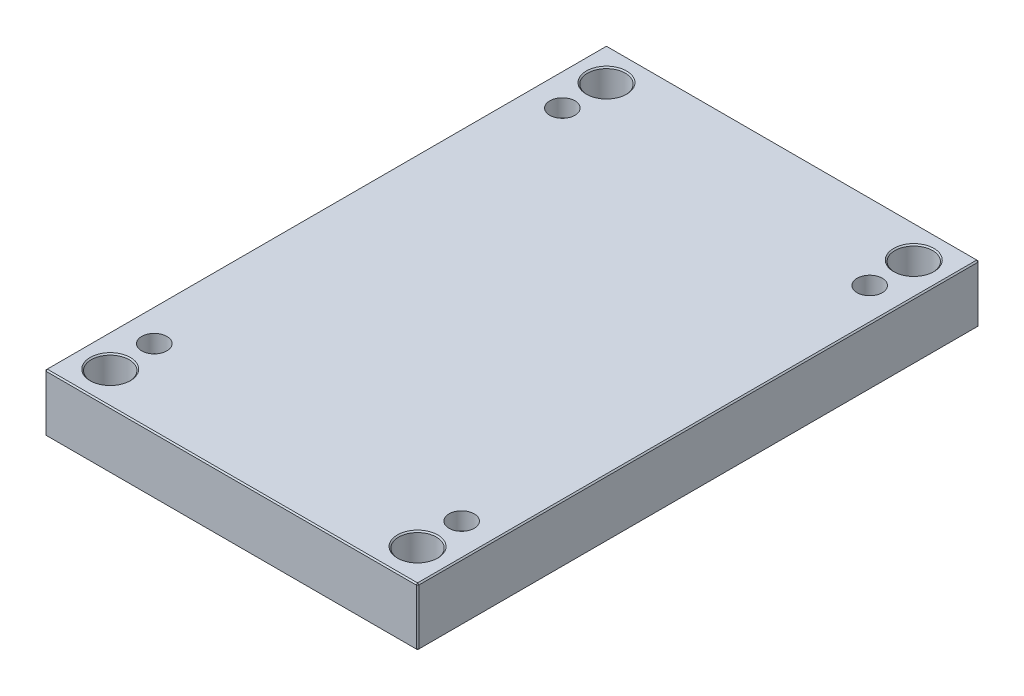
ISO-10303-21;
HEADER;
FILE_DESCRIPTION(('STEP AP214'),'2;1');
FILE_NAME('part.step','',(''),(''),'','','');
FILE_SCHEMA(('AUTOMOTIVE_DESIGN { 1 0 10303 214 1 1 1 1 }'));
ENDSEC;
DATA;
#1=APPLICATION_CONTEXT('core data for automotive mechanical design processes');
#2=APPLICATION_PROTOCOL_DEFINITION('international standard','automotive_design',2000,#1);
#3=PRODUCT_CONTEXT('',#1,'mechanical');
#4=PRODUCT('Part','Part','',(#3));
#5=PRODUCT_RELATED_PRODUCT_CATEGORY('part','',(#4));
#6=PRODUCT_DEFINITION_FORMATION('','',#4);
#7=PRODUCT_DEFINITION_CONTEXT('part definition',#1,'design');
#8=PRODUCT_DEFINITION('design','',#6,#7);
#9=PRODUCT_DEFINITION_SHAPE('','',#8);
#10=(LENGTH_UNIT() NAMED_UNIT(*) SI_UNIT(.MILLI.,.METRE.));
#11=(NAMED_UNIT(*) PLANE_ANGLE_UNIT() SI_UNIT($,.RADIAN.));
#12=(NAMED_UNIT(*) SI_UNIT($,.STERADIAN.) SOLID_ANGLE_UNIT());
#13=UNCERTAINTY_MEASURE_WITH_UNIT(LENGTH_MEASURE(1.E-05),#10,'distance_accuracy_value','');
#14=(GEOMETRIC_REPRESENTATION_CONTEXT(3) GLOBAL_UNCERTAINTY_ASSIGNED_CONTEXT((#13)) GLOBAL_UNIT_ASSIGNED_CONTEXT((#10,
#11,#12)) REPRESENTATION_CONTEXT('',''));
#15=CARTESIAN_POINT('',(0.,0.,0.));
#16=DIRECTION('',(0.,0.,1.));
#17=DIRECTION('',(1.,0.,0.));
#18=AXIS2_PLACEMENT_3D('',#15,#16,#17);
#19=CARTESIAN_POINT('',(-122.,0.,-162.));
#20=DIRECTION('',(0.,1.,0.));
#21=DIRECTION('',(0.,0.,1.));
#22=AXIS2_PLACEMENT_3D('',#19,#20,#21);
#23=CYLINDRICAL_SURFACE('',#22,6.);
#24=CARTESIAN_POINT('',(-122.,0.,-162.));
#25=DIRECTION('',(0.,1.,0.));
#26=DIRECTION('',(0.,0.,1.));
#27=AXIS2_PLACEMENT_3D('',#24,#25,#26);
#28=CIRCLE('',#27,6.);
#29=CARTESIAN_POINT('',(-122.,0.,-156.));
#30=VERTEX_POINT('',#29);
#31=EDGE_CURVE('E150',#30,#30,#28,.T.);
#32=ORIENTED_EDGE('',*,*,#31,.F.);
#33=EDGE_LOOP('',(#32));
#34=FACE_BOUND('',#33,.T.);
#35=CARTESIAN_POINT('',(-122.,32.,-162.));
#36=DIRECTION('',(0.,1.,0.));
#37=DIRECTION('',(0.,0.,1.));
#38=AXIS2_PLACEMENT_3D('',#35,#36,#37);
#39=CIRCLE('',#38,6.);
#40=CARTESIAN_POINT('',(-122.,32.,-156.));
#41=VERTEX_POINT('',#40);
#42=EDGE_CURVE('E20',#41,#41,#39,.F.);
#43=ORIENTED_EDGE('',*,*,#42,.F.);
#44=EDGE_LOOP('',(#43));
#45=FACE_BOUND('',#44,.T.);
#46=ADVANCED_FACE('F16',(#34,#45),#23,.F.);
#47=CARTESIAN_POINT('',(122.,0.,-162.));
#48=DIRECTION('',(0.,1.,0.));
#49=DIRECTION('',(0.,0.,1.));
#50=AXIS2_PLACEMENT_3D('',#47,#48,#49);
#51=CYLINDRICAL_SURFACE('',#50,6.);
#52=CARTESIAN_POINT('',(122.,0.,-162.));
#53=DIRECTION('',(0.,1.,0.));
#54=DIRECTION('',(0.,0.,1.));
#55=AXIS2_PLACEMENT_3D('',#52,#53,#54);
#56=CIRCLE('',#55,6.);
#57=CARTESIAN_POINT('',(122.,0.,-156.));
#58=VERTEX_POINT('',#57);
#59=EDGE_CURVE('E307',#58,#58,#56,.T.);
#60=ORIENTED_EDGE('',*,*,#59,.F.);
#61=EDGE_LOOP('',(#60));
#62=FACE_BOUND('',#61,.T.);
#63=CARTESIAN_POINT('',(122.,32.,-162.));
#64=DIRECTION('',(0.,1.,0.));
#65=DIRECTION('',(0.,0.,1.));
#66=AXIS2_PLACEMENT_3D('',#63,#64,#65);
#67=CIRCLE('',#66,6.);
#68=CARTESIAN_POINT('',(122.,32.,-156.));
#69=VERTEX_POINT('',#68);
#70=EDGE_CURVE('E294',#69,#69,#67,.F.);
#71=ORIENTED_EDGE('',*,*,#70,.F.);
#72=EDGE_LOOP('',(#71));
#73=FACE_BOUND('',#72,.T.);
#74=ADVANCED_FACE('F473',(#62,#73),#51,.F.);
#75=CARTESIAN_POINT('',(122.,0.,162.));
#76=DIRECTION('',(0.,1.,0.));
#77=DIRECTION('',(0.,0.,1.));
#78=AXIS2_PLACEMENT_3D('',#75,#76,#77);
#79=CYLINDRICAL_SURFACE('',#78,6.);
#80=CARTESIAN_POINT('',(122.,0.,162.));
#81=DIRECTION('',(0.,1.,0.));
#82=DIRECTION('',(0.,0.,1.));
#83=AXIS2_PLACEMENT_3D('',#80,#81,#82);
#84=CIRCLE('',#83,6.);
#85=CARTESIAN_POINT('',(122.,0.,168.));
#86=VERTEX_POINT('',#85);
#87=EDGE_CURVE('E303',#86,#86,#84,.T.);
#88=ORIENTED_EDGE('',*,*,#87,.F.);
#89=EDGE_LOOP('',(#88));
#90=FACE_BOUND('',#89,.T.);
#91=CARTESIAN_POINT('',(122.,32.,162.));
#92=DIRECTION('',(0.,1.,0.));
#93=DIRECTION('',(0.,0.,1.));
#94=AXIS2_PLACEMENT_3D('',#91,#92,#93);
#95=CIRCLE('',#94,6.);
#96=CARTESIAN_POINT('',(122.,32.,168.));
#97=VERTEX_POINT('',#96);
#98=EDGE_CURVE('E291',#97,#97,#95,.F.);
#99=ORIENTED_EDGE('',*,*,#98,.F.);
#100=EDGE_LOOP('',(#99));
#101=FACE_BOUND('',#100,.T.);
#102=ADVANCED_FACE('F480',(#90,#101),#79,.F.);
#103=CARTESIAN_POINT('',(-122.,0.,162.));
#104=DIRECTION('',(0.,1.,0.));
#105=DIRECTION('',(0.,0.,1.));
#106=AXIS2_PLACEMENT_3D('',#103,#104,#105);
#107=CYLINDRICAL_SURFACE('',#106,6.);
#108=CARTESIAN_POINT('',(-122.,0.,162.));
#109=DIRECTION('',(0.,1.,0.));
#110=DIRECTION('',(0.,0.,1.));
#111=AXIS2_PLACEMENT_3D('',#108,#109,#110);
#112=CIRCLE('',#111,6.);
#113=CARTESIAN_POINT('',(-122.,0.,168.));
#114=VERTEX_POINT('',#113);
#115=EDGE_CURVE('E299',#114,#114,#112,.T.);
#116=ORIENTED_EDGE('',*,*,#115,.F.);
#117=EDGE_LOOP('',(#116));
#118=FACE_BOUND('',#117,.T.);
#119=CARTESIAN_POINT('',(-122.,32.,162.));
#120=DIRECTION('',(0.,1.,0.));
#121=DIRECTION('',(0.,0.,1.));
#122=AXIS2_PLACEMENT_3D('',#119,#120,#121);
#123=CIRCLE('',#122,6.);
#124=CARTESIAN_POINT('',(-122.,32.,168.));
#125=VERTEX_POINT('',#124);
#126=EDGE_CURVE('E288',#125,#125,#123,.F.);
#127=ORIENTED_EDGE('',*,*,#126,.F.);
#128=EDGE_LOOP('',(#127));
#129=FACE_BOUND('',#128,.T.);
#130=ADVANCED_FACE('F485',(#118,#129),#107,.F.);
#131=CARTESIAN_POINT('',(-148.,46.,223.));
#132=DIRECTION('',(1.,0.,0.));
#133=DIRECTION('',(0.,0.,-1.));
#134=AXIS2_PLACEMENT_3D('',#131,#132,#133);
#135=PLANE('',#134);
#136=DIRECTION('',(0.,-1.,0.));
#137=VECTOR('',#136,1.);
#138=CARTESIAN_POINT('',(-148.,46.,-222.));
#139=LINE('',#138,#137);
#140=CARTESIAN_POINT('',(-148.,45.,-222.));
#141=VERTEX_POINT('',#140);
#142=CARTESIAN_POINT('',(-148.,1.,-222.));
#143=VERTEX_POINT('',#142);
#144=EDGE_CURVE('E118',#141,#143,#139,.T.);
#145=ORIENTED_EDGE('',*,*,#144,.T.);
#146=DIRECTION('',(0.,0.,1.));
#147=VECTOR('',#146,1.);
#148=CARTESIAN_POINT('',(-148.,1.,223.));
#149=LINE('',#148,#147);
#150=CARTESIAN_POINT('',(-148.,1.,222.));
#151=VERTEX_POINT('',#150);
#152=EDGE_CURVE('E114',#143,#151,#149,.T.);
#153=ORIENTED_EDGE('',*,*,#152,.T.);
#154=DIRECTION('',(0.,1.,0.));
#155=VECTOR('',#154,1.);
#156=CARTESIAN_POINT('',(-148.,46.,222.));
#157=LINE('',#156,#155);
#158=CARTESIAN_POINT('',(-148.,45.,222.));
#159=VERTEX_POINT('',#158);
#160=EDGE_CURVE('E106',#151,#159,#157,.T.);
#161=ORIENTED_EDGE('',*,*,#160,.T.);
#162=DIRECTION('',(0.,0.,-1.));
#163=VECTOR('',#162,1.);
#164=CARTESIAN_POINT('',(-148.,45.,-223.));
#165=LINE('',#164,#163);
#166=EDGE_CURVE('E111',#159,#141,#165,.T.);
#167=ORIENTED_EDGE('',*,*,#166,.T.);
#168=EDGE_LOOP('',(#145,#153,#161,#167));
#169=FACE_BOUND('',#168,.T.);
#170=ADVANCED_FACE('F109',(#169),#135,.F.);
#171=CARTESIAN_POINT('',(148.,46.,223.));
#172=DIRECTION('',(0.,0.,-1.));
#173=DIRECTION('',(-1.,0.,0.));
#174=AXIS2_PLACEMENT_3D('',#171,#172,#173);
#175=PLANE('',#174);
#176=DIRECTION('',(-1.,0.,0.));
#177=VECTOR('',#176,1.);
#178=CARTESIAN_POINT('',(-148.,45.,223.));
#179=LINE('',#178,#177);
#180=CARTESIAN_POINT('',(147.,45.,223.));
#181=VERTEX_POINT('',#180);
#182=CARTESIAN_POINT('',(-147.,45.,223.));
#183=VERTEX_POINT('',#182);
#184=EDGE_CURVE('E173',#181,#183,#179,.T.);
#185=ORIENTED_EDGE('',*,*,#184,.T.);
#186=DIRECTION('',(0.,-1.,0.));
#187=VECTOR('',#186,1.);
#188=CARTESIAN_POINT('',(-147.,46.,223.));
#189=LINE('',#188,#187);
#190=CARTESIAN_POINT('',(-147.,0.999999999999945,223.));
#191=VERTEX_POINT('',#190);
#192=EDGE_CURVE('E126',#183,#191,#189,.T.);
#193=ORIENTED_EDGE('',*,*,#192,.T.);
#194=DIRECTION('',(1.,0.,0.));
#195=VECTOR('',#194,1.);
#196=CARTESIAN_POINT('',(148.,0.999999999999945,223.));
#197=LINE('',#196,#195);
#198=CARTESIAN_POINT('',(147.,0.999999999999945,223.));
#199=VERTEX_POINT('',#198);
#200=EDGE_CURVE('E177',#191,#199,#197,.T.);
#201=ORIENTED_EDGE('',*,*,#200,.T.);
#202=DIRECTION('',(0.,1.,0.));
#203=VECTOR('',#202,1.);
#204=CARTESIAN_POINT('',(147.,46.,223.));
#205=LINE('',#204,#203);
#206=EDGE_CURVE('E175',#199,#181,#205,.T.);
#207=ORIENTED_EDGE('',*,*,#206,.T.);
#208=EDGE_LOOP('',(#185,#193,#201,#207));
#209=FACE_BOUND('',#208,.T.);
#210=ADVANCED_FACE('F438',(#209),#175,.F.);
#211=CARTESIAN_POINT('',(148.,46.,223.));
#212=DIRECTION('',(-1.,0.,0.));
#213=DIRECTION('',(0.,0.,1.));
#214=AXIS2_PLACEMENT_3D('',#211,#212,#213);
#215=PLANE('',#214);
#216=DIRECTION('',(0.,0.,-1.));
#217=VECTOR('',#216,1.);
#218=CARTESIAN_POINT('',(148.,0.999999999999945,223.));
#219=LINE('',#218,#217);
#220=CARTESIAN_POINT('',(148.,0.999999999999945,222.));
#221=VERTEX_POINT('',#220);
#222=CARTESIAN_POINT('',(148.,0.999999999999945,-222.));
#223=VERTEX_POINT('',#222);
#224=EDGE_CURVE('E168',#221,#223,#219,.T.);
#225=ORIENTED_EDGE('',*,*,#224,.T.);
#226=DIRECTION('',(0.,1.,0.));
#227=VECTOR('',#226,1.);
#228=CARTESIAN_POINT('',(148.,46.,-222.));
#229=LINE('',#228,#227);
#230=CARTESIAN_POINT('',(148.,45.,-222.));
#231=VERTEX_POINT('',#230);
#232=EDGE_CURVE('E170',#223,#231,#229,.T.);
#233=ORIENTED_EDGE('',*,*,#232,.T.);
#234=DIRECTION('',(0.,0.,1.));
#235=VECTOR('',#234,1.);
#236=CARTESIAN_POINT('',(148.,45.,223.));
#237=LINE('',#236,#235);
#238=CARTESIAN_POINT('',(148.,45.,222.));
#239=VERTEX_POINT('',#238);
#240=EDGE_CURVE('E164',#231,#239,#237,.T.);
#241=ORIENTED_EDGE('',*,*,#240,.T.);
#242=DIRECTION('',(0.,-1.,0.));
#243=VECTOR('',#242,1.);
#244=CARTESIAN_POINT('',(148.,46.,222.));
#245=LINE('',#244,#243);
#246=EDGE_CURVE('E166',#239,#221,#245,.T.);
#247=ORIENTED_EDGE('',*,*,#246,.T.);
#248=EDGE_LOOP('',(#225,#233,#241,#247));
#249=FACE_BOUND('',#248,.T.);
#250=ADVANCED_FACE('F431',(#249),#215,.F.);
#251=CARTESIAN_POINT('',(148.,46.,-223.));
#252=DIRECTION('',(0.,0.,1.));
#253=DIRECTION('',(1.,0.,0.));
#254=AXIS2_PLACEMENT_3D('',#251,#252,#253);
#255=PLANE('',#254);
#256=DIRECTION('',(0.,-1.,0.));
#257=VECTOR('',#256,1.);
#258=CARTESIAN_POINT('',(147.,46.,-223.));
#259=LINE('',#258,#257);
#260=CARTESIAN_POINT('',(147.,45.,-223.));
#261=VERTEX_POINT('',#260);
#262=CARTESIAN_POINT('',(147.,0.999999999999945,-223.));
#263=VERTEX_POINT('',#262);
#264=EDGE_CURVE('E157',#261,#263,#259,.T.);
#265=ORIENTED_EDGE('',*,*,#264,.T.);
#266=DIRECTION('',(-1.,0.,0.));
#267=VECTOR('',#266,1.);
#268=CARTESIAN_POINT('',(148.,0.999999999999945,-223.));
#269=LINE('',#268,#267);
#270=CARTESIAN_POINT('',(-147.,0.999999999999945,-223.));
#271=VERTEX_POINT('',#270);
#272=EDGE_CURVE('E162',#263,#271,#269,.T.);
#273=ORIENTED_EDGE('',*,*,#272,.T.);
#274=DIRECTION('',(0.,1.,0.));
#275=VECTOR('',#274,1.);
#276=CARTESIAN_POINT('',(-147.,46.,-223.));
#277=LINE('',#276,#275);
#278=CARTESIAN_POINT('',(-147.,45.,-223.));
#279=VERTEX_POINT('',#278);
#280=EDGE_CURVE('E159',#271,#279,#277,.T.);
#281=ORIENTED_EDGE('',*,*,#280,.T.);
#282=DIRECTION('',(1.,0.,0.));
#283=VECTOR('',#282,1.);
#284=CARTESIAN_POINT('',(148.,45.,-223.));
#285=LINE('',#284,#283);
#286=EDGE_CURVE('E155',#279,#261,#285,.T.);
#287=ORIENTED_EDGE('',*,*,#286,.T.);
#288=EDGE_LOOP('',(#265,#273,#281,#287));
#289=FACE_BOUND('',#288,.T.);
#290=ADVANCED_FACE('F349',(#289),#255,.F.);
#291=CARTESIAN_POINT('',(0.,46.,0.));
#292=DIRECTION('',(0.,1.,0.));
#293=DIRECTION('',(0.,0.,1.));
#294=AXIS2_PLACEMENT_3D('',#291,#292,#293);
#295=PLANE('',#294);
#296=CARTESIAN_POINT('',(-122.,46.,162.));
#297=DIRECTION('',(0.,1.,0.));
#298=DIRECTION('',(0.,0.,1.));
#299=AXIS2_PLACEMENT_3D('',#296,#297,#298);
#300=CIRCLE('',#299,10.);
#301=CARTESIAN_POINT('',(-122.,46.,172.));
#302=VERTEX_POINT('',#301);
#303=EDGE_CURVE('E318',#302,#302,#300,.T.);
#304=ORIENTED_EDGE('',*,*,#303,.F.);
#305=EDGE_LOOP('',(#304));
#306=FACE_BOUND('',#305,.T.);
#307=CARTESIAN_POINT('',(122.,46.,162.));
#308=DIRECTION('',(0.,1.,0.));
#309=DIRECTION('',(0.,0.,1.));
#310=AXIS2_PLACEMENT_3D('',#307,#308,#309);
#311=CIRCLE('',#310,10.);
#312=CARTESIAN_POINT('',(122.,46.,172.));
#313=VERTEX_POINT('',#312);
#314=EDGE_CURVE('E324',#313,#313,#311,.T.);
#315=ORIENTED_EDGE('',*,*,#314,.F.);
#316=EDGE_LOOP('',(#315));
#317=FACE_BOUND('',#316,.T.);
#318=CARTESIAN_POINT('',(122.,46.,-162.));
#319=DIRECTION('',(0.,1.,0.));
#320=DIRECTION('',(0.,0.,1.));
#321=AXIS2_PLACEMENT_3D('',#318,#319,#320);
#322=CIRCLE('',#321,10.);
#323=CARTESIAN_POINT('',(122.,46.,-152.));
#324=VERTEX_POINT('',#323);
#325=EDGE_CURVE('E330',#324,#324,#322,.T.);
#326=ORIENTED_EDGE('',*,*,#325,.F.);
#327=EDGE_LOOP('',(#326));
#328=FACE_BOUND('',#327,.T.);
#329=CARTESIAN_POINT('',(-122.,46.,-162.));
#330=DIRECTION('',(0.,1.,0.));
#331=DIRECTION('',(0.,0.,1.));
#332=AXIS2_PLACEMENT_3D('',#329,#330,#331);
#333=CIRCLE('',#332,10.);
#334=CARTESIAN_POINT('',(-122.,46.,-152.));
#335=VERTEX_POINT('',#334);
#336=EDGE_CURVE('E312',#335,#335,#333,.T.);
#337=ORIENTED_EDGE('',*,*,#336,.F.);
#338=EDGE_LOOP('',(#337));
#339=FACE_BOUND('',#338,.T.);
#340=CARTESIAN_POINT('',(-122.,46.,197.));
#341=DIRECTION('',(0.,1.,0.));
#342=DIRECTION('',(0.,0.,1.));
#343=AXIS2_PLACEMENT_3D('',#340,#341,#342);
#344=CIRCLE('',#343,16.);
#345=CARTESIAN_POINT('',(-122.,46.,213.));
#346=VERTEX_POINT('',#345);
#347=EDGE_CURVE('E259',#346,#346,#344,.F.);
#348=ORIENTED_EDGE('',*,*,#347,.T.);
#349=EDGE_LOOP('',(#348));
#350=FACE_BOUND('',#349,.T.);
#351=CARTESIAN_POINT('',(122.,46.,197.));
#352=DIRECTION('',(0.,1.,0.));
#353=DIRECTION('',(0.,0.,1.));
#354=AXIS2_PLACEMENT_3D('',#351,#352,#353);
#355=CIRCLE('',#354,16.);
#356=CARTESIAN_POINT('',(122.,46.,213.));
#357=VERTEX_POINT('',#356);
#358=EDGE_CURVE('E256',#357,#357,#355,.F.);
#359=ORIENTED_EDGE('',*,*,#358,.T.);
#360=EDGE_LOOP('',(#359));
#361=FACE_BOUND('',#360,.T.);
#362=CARTESIAN_POINT('',(122.,46.,-197.));
#363=DIRECTION('',(0.,1.,0.));
#364=DIRECTION('',(0.,0.,1.));
#365=AXIS2_PLACEMENT_3D('',#362,#363,#364);
#366=CIRCLE('',#365,16.);
#367=CARTESIAN_POINT('',(122.,46.,-181.));
#368=VERTEX_POINT('',#367);
#369=EDGE_CURVE('E253',#368,#368,#366,.F.);
#370=ORIENTED_EDGE('',*,*,#369,.T.);
#371=EDGE_LOOP('',(#370));
#372=FACE_BOUND('',#371,.T.);
#373=CARTESIAN_POINT('',(-122.,46.,-197.));
#374=DIRECTION('',(0.,1.,0.));
#375=DIRECTION('',(0.,0.,1.));
#376=AXIS2_PLACEMENT_3D('',#373,#374,#375);
#377=CIRCLE('',#376,16.);
#378=CARTESIAN_POINT('',(-122.,46.,-181.));
#379=VERTEX_POINT('',#378);
#380=EDGE_CURVE('E250',#379,#379,#377,.F.);
#381=ORIENTED_EDGE('',*,*,#380,.T.);
#382=EDGE_LOOP('',(#381));
#383=FACE_BOUND('',#382,.T.);
#384=DIRECTION('',(0.,0.,-1.));
#385=VECTOR('',#384,1.);
#386=CARTESIAN_POINT('',(147.,46.,-223.));
#387=LINE('',#386,#385);
#388=CARTESIAN_POINT('',(147.,46.,222.));
#389=VERTEX_POINT('',#388);
#390=CARTESIAN_POINT('',(147.,46.,-222.));
#391=VERTEX_POINT('',#390);
#392=EDGE_CURVE('E33',#389,#391,#387,.T.);
#393=ORIENTED_EDGE('',*,*,#392,.T.);
#394=DIRECTION('',(-1.,0.,0.));
#395=VECTOR('',#394,1.);
#396=CARTESIAN_POINT('',(-148.,46.,-222.));
#397=LINE('',#396,#395);
#398=CARTESIAN_POINT('',(-147.,46.,-222.));
#399=VERTEX_POINT('',#398);
#400=EDGE_CURVE('E193',#391,#399,#397,.T.);
#401=ORIENTED_EDGE('',*,*,#400,.T.);
#402=DIRECTION('',(0.,0.,1.));
#403=VECTOR('',#402,1.);
#404=CARTESIAN_POINT('',(-147.,46.,223.));
#405=LINE('',#404,#403);
#406=CARTESIAN_POINT('',(-147.,46.,222.));
#407=VERTEX_POINT('',#406);
#408=EDGE_CURVE('E189',#399,#407,#405,.T.);
#409=ORIENTED_EDGE('',*,*,#408,.T.);
#410=DIRECTION('',(1.,0.,0.));
#411=VECTOR('',#410,1.);
#412=CARTESIAN_POINT('',(148.,46.,222.));
#413=LINE('',#412,#411);
#414=EDGE_CURVE('E38',#407,#389,#413,.T.);
#415=ORIENTED_EDGE('',*,*,#414,.T.);
#416=EDGE_LOOP('',(#393,#401,#409,#415));
#417=FACE_BOUND('',#416,.T.);
#418=ADVANCED_FACE('F345',(#306,#317,#328,#339,#350,#361,#372,#383,#417),#295,.T.);
#419=CARTESIAN_POINT('',(0.,0.,0.));
#420=DIRECTION('',(0.,1.,0.));
#421=DIRECTION('',(0.,0.,1.));
#422=AXIS2_PLACEMENT_3D('',#419,#420,#421);
#423=PLANE('',#422);
#424=CARTESIAN_POINT('',(-122.,0.,197.));
#425=DIRECTION('',(0.,1.,0.));
#426=DIRECTION('',(0.,0.,1.));
#427=AXIS2_PLACEMENT_3D('',#424,#425,#426);
#428=CIRCLE('',#427,16.);
#429=CARTESIAN_POINT('',(-122.,0.,213.));
#430=VERTEX_POINT('',#429);
#431=EDGE_CURVE('E271',#430,#430,#428,.T.);
#432=ORIENTED_EDGE('',*,*,#431,.T.);
#433=EDGE_LOOP('',(#432));
#434=FACE_BOUND('',#433,.T.);
#435=CARTESIAN_POINT('',(122.,0.,197.));
#436=DIRECTION('',(0.,1.,0.));
#437=DIRECTION('',(0.,0.,1.));
#438=AXIS2_PLACEMENT_3D('',#435,#436,#437);
#439=CIRCLE('',#438,16.);
#440=CARTESIAN_POINT('',(122.,0.,213.));
#441=VERTEX_POINT('',#440);
#442=EDGE_CURVE('E268',#441,#441,#439,.T.);
#443=ORIENTED_EDGE('',*,*,#442,.T.);
#444=EDGE_LOOP('',(#443));
#445=FACE_BOUND('',#444,.T.);
#446=CARTESIAN_POINT('',(122.,0.,-197.));
#447=DIRECTION('',(0.,1.,0.));
#448=DIRECTION('',(0.,0.,1.));
#449=AXIS2_PLACEMENT_3D('',#446,#447,#448);
#450=CIRCLE('',#449,16.);
#451=CARTESIAN_POINT('',(122.,0.,-181.));
#452=VERTEX_POINT('',#451);
#453=EDGE_CURVE('E265',#452,#452,#450,.T.);
#454=ORIENTED_EDGE('',*,*,#453,.T.);
#455=EDGE_LOOP('',(#454));
#456=FACE_BOUND('',#455,.T.);
#457=CARTESIAN_POINT('',(-122.,0.,-197.));
#458=DIRECTION('',(0.,1.,0.));
#459=DIRECTION('',(0.,0.,1.));
#460=AXIS2_PLACEMENT_3D('',#457,#458,#459);
#461=CIRCLE('',#460,16.);
#462=CARTESIAN_POINT('',(-122.,0.,-181.));
#463=VERTEX_POINT('',#462);
#464=EDGE_CURVE('E262',#463,#463,#461,.T.);
#465=ORIENTED_EDGE('',*,*,#464,.T.);
#466=EDGE_LOOP('',(#465));
#467=FACE_BOUND('',#466,.T.);
#468=ORIENTED_EDGE('',*,*,#115,.T.);
#469=EDGE_LOOP('',(#468));
#470=FACE_BOUND('',#469,.T.);
#471=ORIENTED_EDGE('',*,*,#87,.T.);
#472=EDGE_LOOP('',(#471));
#473=FACE_BOUND('',#472,.T.);
#474=ORIENTED_EDGE('',*,*,#59,.T.);
#475=EDGE_LOOP('',(#474));
#476=FACE_BOUND('',#475,.T.);
#477=ORIENTED_EDGE('',*,*,#31,.T.);
#478=EDGE_LOOP('',(#477));
#479=FACE_BOUND('',#478,.T.);
#480=DIRECTION('',(0.,0.,1.));
#481=VECTOR('',#480,1.);
#482=CARTESIAN_POINT('',(147.,0.,0.));
#483=LINE('',#482,#481);
#484=CARTESIAN_POINT('',(147.,0.,-222.));
#485=VERTEX_POINT('',#484);
#486=CARTESIAN_POINT('',(147.,0.,222.));
#487=VERTEX_POINT('',#486);
#488=EDGE_CURVE('E180',#485,#487,#483,.T.);
#489=ORIENTED_EDGE('',*,*,#488,.T.);
#490=DIRECTION('',(-1.,0.,0.));
#491=VECTOR('',#490,1.);
#492=CARTESIAN_POINT('',(0.,0.,222.));
#493=LINE('',#492,#491);
#494=CARTESIAN_POINT('',(-147.,0.,222.));
#495=VERTEX_POINT('',#494);
#496=EDGE_CURVE('E186',#487,#495,#493,.T.);
#497=ORIENTED_EDGE('',*,*,#496,.T.);
#498=DIRECTION('',(0.,0.,-1.));
#499=VECTOR('',#498,1.);
#500=CARTESIAN_POINT('',(-147.,0.,0.));
#501=LINE('',#500,#499);
#502=CARTESIAN_POINT('',(-147.,0.,-222.));
#503=VERTEX_POINT('',#502);
#504=EDGE_CURVE('E184',#495,#503,#501,.T.);
#505=ORIENTED_EDGE('',*,*,#504,.T.);
#506=DIRECTION('',(1.,0.,0.));
#507=VECTOR('',#506,1.);
#508=CARTESIAN_POINT('',(0.,0.,-222.));
#509=LINE('',#508,#507);
#510=EDGE_CURVE('E182',#503,#485,#509,.T.);
#511=ORIENTED_EDGE('',*,*,#510,.T.);
#512=EDGE_LOOP('',(#489,#497,#505,#511));
#513=FACE_BOUND('',#512,.T.);
#514=ADVANCED_FACE('F348',(#434,#445,#456,#467,#470,#473,#476,#479,#513),#423,.F.);
#515=CARTESIAN_POINT('',(148.,46.,222.));
#516=DIRECTION('',(-0.707106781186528,0.,-0.707106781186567));
#517=DIRECTION('',(0.,-1.,0.));
#518=AXIS2_PLACEMENT_3D('',#515,#516,#517);
#519=PLANE('',#518);
#520=DIRECTION('',(-0.707106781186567,0.,0.707106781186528));
#521=VECTOR('',#520,1.);
#522=CARTESIAN_POINT('',(147.,45.,223.));
#523=LINE('',#522,#521);
#524=EDGE_CURVE('E144',#181,#239,#523,.F.);
#525=ORIENTED_EDGE('',*,*,#524,.F.);
#526=ORIENTED_EDGE('',*,*,#206,.F.);
#527=DIRECTION('',(0.707106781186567,0.,-0.707106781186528));
#528=VECTOR('',#527,1.);
#529=CARTESIAN_POINT('',(147.,0.999999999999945,223.));
#530=LINE('',#529,#528);
#531=EDGE_CURVE('E147',#221,#199,#530,.F.);
#532=ORIENTED_EDGE('',*,*,#531,.F.);
#533=ORIENTED_EDGE('',*,*,#246,.F.);
#534=EDGE_LOOP('',(#525,#526,#532,#533));
#535=FACE_BOUND('',#534,.T.);
#536=ADVANCED_FACE('F382',(#535),#519,.F.);
#537=CARTESIAN_POINT('',(147.,45.,223.));
#538=DIRECTION('',(0.577350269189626,0.577350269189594,0.577350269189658));
#539=DIRECTION('',(0.707106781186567,0.,-0.707106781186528));
#540=AXIS2_PLACEMENT_3D('',#537,#538,#539);
#541=PLANE('',#540);
#542=DIRECTION('',(0.,-0.707106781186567,0.707106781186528));
#543=VECTOR('',#542,1.);
#544=CARTESIAN_POINT('',(147.,45.,223.));
#545=LINE('',#544,#543);
#546=EDGE_CURVE('E238',#181,#389,#545,.F.);
#547=ORIENTED_EDGE('',*,*,#546,.F.);
#548=ORIENTED_EDGE('',*,*,#524,.T.);
#549=DIRECTION('',(-0.707106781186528,0.707106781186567,0.));
#550=VECTOR('',#549,1.);
#551=CARTESIAN_POINT('',(147.5,45.5,222.));
#552=LINE('',#551,#550);
#553=EDGE_CURVE('E240',#389,#239,#552,.F.);
#554=ORIENTED_EDGE('',*,*,#553,.F.);
#555=EDGE_LOOP('',(#547,#548,#554));
#556=FACE_BOUND('',#555,.T.);
#557=ADVANCED_FACE('F444',(#556),#541,.T.);
#558=CARTESIAN_POINT('',(147.,0.999999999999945,223.));
#559=DIRECTION('',(0.577350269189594,-0.577350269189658,0.577350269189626));
#560=DIRECTION('',(0.,-0.707106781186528,-0.707106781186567));
#561=AXIS2_PLACEMENT_3D('',#558,#559,#560);
#562=PLANE('',#561);
#563=DIRECTION('',(-0.707106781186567,-0.707106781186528,0.));
#564=VECTOR('',#563,1.);
#565=CARTESIAN_POINT('',(147.5,0.499999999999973,222.));
#566=LINE('',#565,#564);
#567=EDGE_CURVE('E232',#221,#487,#566,.T.);
#568=ORIENTED_EDGE('',*,*,#567,.F.);
#569=ORIENTED_EDGE('',*,*,#531,.T.);
#570=DIRECTION('',(0.,0.707106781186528,0.707106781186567));
#571=VECTOR('',#570,1.);
#572=CARTESIAN_POINT('',(147.,0.999999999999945,223.));
#573=LINE('',#572,#571);
#574=EDGE_CURVE('E235',#487,#199,#573,.T.);
#575=ORIENTED_EDGE('',*,*,#574,.F.);
#576=EDGE_LOOP('',(#568,#569,#575));
#577=FACE_BOUND('',#576,.T.);
#578=ADVANCED_FACE('F403',(#577),#562,.T.);
#579=CARTESIAN_POINT('',(147.,46.,0.));
#580=DIRECTION('',(0.707106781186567,0.707106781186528,0.));
#581=DIRECTION('',(0.,0.,1.));
#582=AXIS2_PLACEMENT_3D('',#579,#580,#581);
#583=PLANE('',#582);
#584=ORIENTED_EDGE('',*,*,#553,.T.);
#585=ORIENTED_EDGE('',*,*,#240,.F.);
#586=DIRECTION('',(0.707106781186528,-0.707106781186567,0.));
#587=VECTOR('',#586,1.);
#588=CARTESIAN_POINT('',(148.,45.,-222.));
#589=LINE('',#588,#587);
#590=EDGE_CURVE('E227',#391,#231,#589,.T.);
#591=ORIENTED_EDGE('',*,*,#590,.F.);
#592=ORIENTED_EDGE('',*,*,#392,.F.);
#593=EDGE_LOOP('',(#584,#585,#591,#592));
#594=FACE_BOUND('',#593,.T.);
#595=ADVANCED_FACE('F446',(#594),#583,.T.);
#596=CARTESIAN_POINT('',(0.,46.,222.));
#597=DIRECTION('',(0.,0.707106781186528,0.707106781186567));
#598=DIRECTION('',(-1.,0.,0.));
#599=AXIS2_PLACEMENT_3D('',#596,#597,#598);
#600=PLANE('',#599);
#601=ORIENTED_EDGE('',*,*,#546,.T.);
#602=ORIENTED_EDGE('',*,*,#414,.F.);
#603=DIRECTION('',(0.,0.707106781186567,-0.707106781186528));
#604=VECTOR('',#603,1.);
#605=CARTESIAN_POINT('',(-147.,45.5,222.5));
#606=LINE('',#605,#604);
#607=EDGE_CURVE('E130',#183,#407,#606,.T.);
#608=ORIENTED_EDGE('',*,*,#607,.F.);
#609=ORIENTED_EDGE('',*,*,#184,.F.);
#610=EDGE_LOOP('',(#601,#602,#608,#609));
#611=FACE_BOUND('',#610,.T.);
#612=ADVANCED_FACE('F441',(#611),#600,.T.);
#613=CARTESIAN_POINT('',(-147.,46.,223.));
#614=DIRECTION('',(0.707106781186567,0.,-0.707106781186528));
#615=DIRECTION('',(0.,-1.,0.));
#616=AXIS2_PLACEMENT_3D('',#613,#614,#615);
#617=PLANE('',#616);
#618=DIRECTION('',(0.707106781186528,0.,0.707106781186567));
#619=VECTOR('',#618,1.);
#620=CARTESIAN_POINT('',(-147.,0.999999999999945,223.));
#621=LINE('',#620,#619);
#622=EDGE_CURVE('E131',#191,#151,#621,.F.);
#623=ORIENTED_EDGE('',*,*,#622,.F.);
#624=ORIENTED_EDGE('',*,*,#192,.F.);
#625=DIRECTION('',(-0.707106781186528,0.,-0.707106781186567));
#626=VECTOR('',#625,1.);
#627=CARTESIAN_POINT('',(-148.,45.,222.));
#628=LINE('',#627,#626);
#629=EDGE_CURVE('E122',#159,#183,#628,.F.);
#630=ORIENTED_EDGE('',*,*,#629,.F.);
#631=ORIENTED_EDGE('',*,*,#160,.F.);
#632=EDGE_LOOP('',(#623,#624,#630,#631));
#633=FACE_BOUND('',#632,.T.);
#634=ADVANCED_FACE('F124',(#633),#617,.F.);
#635=CARTESIAN_POINT('',(148.,0.999999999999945,223.));
#636=DIRECTION('',(0.,0.707106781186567,-0.707106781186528));
#637=DIRECTION('',(1.,0.,0.));
#638=AXIS2_PLACEMENT_3D('',#635,#636,#637);
#639=PLANE('',#638);
#640=ORIENTED_EDGE('',*,*,#574,.T.);
#641=ORIENTED_EDGE('',*,*,#200,.F.);
#642=DIRECTION('',(0.,-0.707106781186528,-0.707106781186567));
#643=VECTOR('',#642,1.);
#644=CARTESIAN_POINT('',(-147.,0.999999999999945,223.));
#645=LINE('',#644,#643);
#646=EDGE_CURVE('E223',#495,#191,#645,.F.);
#647=ORIENTED_EDGE('',*,*,#646,.F.);
#648=ORIENTED_EDGE('',*,*,#496,.F.);
#649=EDGE_LOOP('',(#640,#641,#647,#648));
#650=FACE_BOUND('',#649,.T.);
#651=ADVANCED_FACE('F408',(#650),#639,.F.);
#652=CARTESIAN_POINT('',(148.,0.999999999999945,223.));
#653=DIRECTION('',(-0.707106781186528,0.707106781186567,0.));
#654=DIRECTION('',(0.,0.,-1.));
#655=AXIS2_PLACEMENT_3D('',#652,#653,#654);
#656=PLANE('',#655);
#657=ORIENTED_EDGE('',*,*,#567,.T.);
#658=ORIENTED_EDGE('',*,*,#488,.F.);
#659=DIRECTION('',(0.707106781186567,0.707106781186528,0.));
#660=VECTOR('',#659,1.);
#661=CARTESIAN_POINT('',(147.5,0.499999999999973,-222.));
#662=LINE('',#661,#660);
#663=EDGE_CURVE('E220',#223,#485,#662,.F.);
#664=ORIENTED_EDGE('',*,*,#663,.F.);
#665=ORIENTED_EDGE('',*,*,#224,.F.);
#666=EDGE_LOOP('',(#657,#658,#664,#665));
#667=FACE_BOUND('',#666,.T.);
#668=ADVANCED_FACE('F401',(#667),#656,.F.);
#669=CARTESIAN_POINT('',(147.,46.,-223.));
#670=DIRECTION('',(-0.707106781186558,0.,0.707106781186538));
#671=DIRECTION('',(0.,-1.,0.));
#672=AXIS2_PLACEMENT_3D('',#669,#670,#671);
#673=PLANE('',#672);
#674=DIRECTION('',(0.707106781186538,0.,0.707106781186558));
#675=VECTOR('',#674,1.);
#676=CARTESIAN_POINT('',(148.,45.,-222.));
#677=LINE('',#676,#675);
#678=EDGE_CURVE('E229',#231,#261,#677,.F.);
#679=ORIENTED_EDGE('',*,*,#678,.F.);
#680=ORIENTED_EDGE('',*,*,#232,.F.);
#681=DIRECTION('',(-0.707106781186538,0.,-0.707106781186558));
#682=VECTOR('',#681,1.);
#683=CARTESIAN_POINT('',(147.,0.999999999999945,-223.));
#684=LINE('',#683,#682);
#685=EDGE_CURVE('E217',#263,#223,#684,.F.);
#686=ORIENTED_EDGE('',*,*,#685,.F.);
#687=ORIENTED_EDGE('',*,*,#264,.F.);
#688=EDGE_LOOP('',(#679,#680,#686,#687));
#689=FACE_BOUND('',#688,.T.);
#690=ADVANCED_FACE('F428',(#689),#673,.F.);
#691=CARTESIAN_POINT('',(148.,45.,-222.));
#692=DIRECTION('',(0.577350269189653,0.577350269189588,-0.577350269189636));
#693=DIRECTION('',(-0.707106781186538,0.,-0.707106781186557));
#694=AXIS2_PLACEMENT_3D('',#691,#692,#693);
#695=PLANE('',#694);
#696=ORIENTED_EDGE('',*,*,#590,.T.);
#697=ORIENTED_EDGE('',*,*,#678,.T.);
#698=DIRECTION('',(0.,0.707106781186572,0.707106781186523));
#699=VECTOR('',#698,1.);
#700=CARTESIAN_POINT('',(147.,45.5,-222.5));
#701=LINE('',#700,#699);
#702=EDGE_CURVE('E138',#391,#261,#701,.F.);
#703=ORIENTED_EDGE('',*,*,#702,.F.);
#704=EDGE_LOOP('',(#696,#697,#703));
#705=FACE_BOUND('',#704,.T.);
#706=ADVANCED_FACE('F450',(#705),#695,.T.);
#707=CARTESIAN_POINT('',(-148.,45.,222.));
#708=DIRECTION('',(-0.577350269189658,0.577350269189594,0.577350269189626));
#709=DIRECTION('',(0.707106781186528,0.,0.707106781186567));
#710=AXIS2_PLACEMENT_3D('',#707,#708,#709);
#711=PLANE('',#710);
#712=ORIENTED_EDGE('',*,*,#629,.T.);
#713=ORIENTED_EDGE('',*,*,#607,.T.);
#714=DIRECTION('',(-0.707106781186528,-0.707106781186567,0.));
#715=VECTOR('',#714,1.);
#716=CARTESIAN_POINT('',(-148.,45.,222.));
#717=LINE('',#716,#715);
#718=EDGE_CURVE('E134',#159,#407,#717,.F.);
#719=ORIENTED_EDGE('',*,*,#718,.F.);
#720=EDGE_LOOP('',(#712,#713,#719));
#721=FACE_BOUND('',#720,.T.);
#722=ADVANCED_FACE('F135',(#721),#711,.T.);
#723=CARTESIAN_POINT('',(-147.,0.999999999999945,223.));
#724=DIRECTION('',(-0.577350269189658,-0.577350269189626,0.577350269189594));
#725=DIRECTION('',(0.707106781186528,-0.707106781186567,0.));
#726=AXIS2_PLACEMENT_3D('',#723,#724,#725);
#727=PLANE('',#726);
#728=ORIENTED_EDGE('',*,*,#646,.T.);
#729=ORIENTED_EDGE('',*,*,#622,.T.);
#730=DIRECTION('',(-0.707106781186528,0.707106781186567,0.));
#731=VECTOR('',#730,1.);
#732=CARTESIAN_POINT('',(-147.5,0.5,222.));
#733=LINE('',#732,#731);
#734=EDGE_CURVE('E139',#495,#151,#733,.T.);
#735=ORIENTED_EDGE('',*,*,#734,.F.);
#736=EDGE_LOOP('',(#728,#729,#735));
#737=FACE_BOUND('',#736,.T.);
#738=ADVANCED_FACE('F411',(#737),#727,.T.);
#739=CARTESIAN_POINT('',(147.,0.999999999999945,-223.));
#740=DIRECTION('',(0.57735026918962,-0.577350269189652,-0.577350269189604));
#741=DIRECTION('',(0.707106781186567,0.707106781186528,0.));
#742=AXIS2_PLACEMENT_3D('',#739,#740,#741);
#743=PLANE('',#742);
#744=ORIENTED_EDGE('',*,*,#685,.T.);
#745=ORIENTED_EDGE('',*,*,#663,.T.);
#746=DIRECTION('',(0.,-0.707106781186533,0.707106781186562));
#747=VECTOR('',#746,1.);
#748=CARTESIAN_POINT('',(147.,0.999999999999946,-223.));
#749=LINE('',#748,#747);
#750=EDGE_CURVE('E210',#263,#485,#749,.T.);
#751=ORIENTED_EDGE('',*,*,#750,.F.);
#752=EDGE_LOOP('',(#744,#745,#751));
#753=FACE_BOUND('',#752,.T.);
#754=ADVANCED_FACE('F422',(#753),#743,.T.);
#755=CARTESIAN_POINT('',(0.,46.,-222.));
#756=DIRECTION('',(0.,0.707106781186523,-0.707106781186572));
#757=DIRECTION('',(1.,0.,0.));
#758=AXIS2_PLACEMENT_3D('',#755,#756,#757);
#759=PLANE('',#758);
#760=ORIENTED_EDGE('',*,*,#702,.T.);
#761=ORIENTED_EDGE('',*,*,#286,.F.);
#762=DIRECTION('',(0.,-0.707106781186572,-0.707106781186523));
#763=VECTOR('',#762,1.);
#764=CARTESIAN_POINT('',(-147.,45.,-223.));
#765=LINE('',#764,#763);
#766=EDGE_CURVE('E207',#399,#279,#765,.T.);
#767=ORIENTED_EDGE('',*,*,#766,.F.);
#768=ORIENTED_EDGE('',*,*,#400,.F.);
#769=EDGE_LOOP('',(#760,#761,#767,#768));
#770=FACE_BOUND('',#769,.T.);
#771=ADVANCED_FACE('F454',(#770),#759,.T.);
#772=CARTESIAN_POINT('',(-147.,46.,0.));
#773=DIRECTION('',(-0.707106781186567,0.707106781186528,0.));
#774=DIRECTION('',(0.,0.,-1.));
#775=AXIS2_PLACEMENT_3D('',#772,#773,#774);
#776=PLANE('',#775);
#777=ORIENTED_EDGE('',*,*,#718,.T.);
#778=ORIENTED_EDGE('',*,*,#408,.F.);
#779=DIRECTION('',(0.707106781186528,0.707106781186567,0.));
#780=VECTOR('',#779,1.);
#781=CARTESIAN_POINT('',(-147.5,45.5,-222.));
#782=LINE('',#781,#780);
#783=EDGE_CURVE('E142',#141,#399,#782,.T.);
#784=ORIENTED_EDGE('',*,*,#783,.F.);
#785=ORIENTED_EDGE('',*,*,#166,.F.);
#786=EDGE_LOOP('',(#777,#778,#784,#785));
#787=FACE_BOUND('',#786,.T.);
#788=ADVANCED_FACE('F141',(#787),#776,.T.);
#789=CARTESIAN_POINT('',(-148.,1.,223.));
#790=DIRECTION('',(0.707106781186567,0.707106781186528,0.));
#791=DIRECTION('',(0.,0.,1.));
#792=AXIS2_PLACEMENT_3D('',#789,#790,#791);
#793=PLANE('',#792);
#794=ORIENTED_EDGE('',*,*,#734,.T.);
#795=ORIENTED_EDGE('',*,*,#152,.F.);
#796=DIRECTION('',(0.707106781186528,-0.707106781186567,0.));
#797=VECTOR('',#796,1.);
#798=CARTESIAN_POINT('',(-148.,1.,-222.));
#799=LINE('',#798,#797);
#800=EDGE_CURVE('E203',#503,#143,#799,.F.);
#801=ORIENTED_EDGE('',*,*,#800,.F.);
#802=ORIENTED_EDGE('',*,*,#504,.F.);
#803=EDGE_LOOP('',(#794,#795,#801,#802));
#804=FACE_BOUND('',#803,.T.);
#805=ADVANCED_FACE('F413',(#804),#793,.F.);
#806=CARTESIAN_POINT('',(148.,0.999999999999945,-223.));
#807=DIRECTION('',(0.,0.707106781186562,0.707106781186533));
#808=DIRECTION('',(-1.,0.,0.));
#809=AXIS2_PLACEMENT_3D('',#806,#807,#808);
#810=PLANE('',#809);
#811=ORIENTED_EDGE('',*,*,#750,.T.);
#812=ORIENTED_EDGE('',*,*,#510,.F.);
#813=DIRECTION('',(0.,0.707106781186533,-0.707106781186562));
#814=VECTOR('',#813,1.);
#815=CARTESIAN_POINT('',(-147.,0.499999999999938,-222.5));
#816=LINE('',#815,#814);
#817=EDGE_CURVE('E200',#271,#503,#816,.F.);
#818=ORIENTED_EDGE('',*,*,#817,.F.);
#819=ORIENTED_EDGE('',*,*,#272,.F.);
#820=EDGE_LOOP('',(#811,#812,#818,#819));
#821=FACE_BOUND('',#820,.T.);
#822=ADVANCED_FACE('F417',(#821),#810,.F.);
#823=CARTESIAN_POINT('',(-147.,45.,-223.));
#824=DIRECTION('',(-0.577350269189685,0.577350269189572,-0.57735026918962));
#825=DIRECTION('',(-0.707106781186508,0.,0.707106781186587));
#826=AXIS2_PLACEMENT_3D('',#823,#824,#825);
#827=PLANE('',#826);
#828=ORIENTED_EDGE('',*,*,#783,.T.);
#829=ORIENTED_EDGE('',*,*,#766,.T.);
#830=DIRECTION('',(0.707106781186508,0.,-0.707106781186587));
#831=VECTOR('',#830,1.);
#832=CARTESIAN_POINT('',(-147.,45.,-223.));
#833=LINE('',#832,#831);
#834=EDGE_CURVE('E198',#141,#279,#833,.T.);
#835=ORIENTED_EDGE('',*,*,#834,.F.);
#836=EDGE_LOOP('',(#828,#829,#835));
#837=FACE_BOUND('',#836,.T.);
#838=ADVANCED_FACE('F456',(#837),#827,.T.);
#839=CARTESIAN_POINT('',(-148.,1.,-222.));
#840=DIRECTION('',(-0.577350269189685,-0.577350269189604,-0.577350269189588));
#841=DIRECTION('',(0.707106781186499,-0.707106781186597,0.));
#842=AXIS2_PLACEMENT_3D('',#839,#840,#841);
#843=PLANE('',#842);
#844=ORIENTED_EDGE('',*,*,#817,.T.);
#845=ORIENTED_EDGE('',*,*,#800,.T.);
#846=DIRECTION('',(-0.707106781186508,0.,0.707106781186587));
#847=VECTOR('',#846,1.);
#848=CARTESIAN_POINT('',(-148.,1.,-222.));
#849=LINE('',#848,#847);
#850=EDGE_CURVE('E196',#271,#143,#849,.T.);
#851=ORIENTED_EDGE('',*,*,#850,.F.);
#852=EDGE_LOOP('',(#844,#845,#851));
#853=FACE_BOUND('',#852,.T.);
#854=ADVANCED_FACE('F461',(#853),#843,.T.);
#855=CARTESIAN_POINT('',(-148.,46.,-222.));
#856=DIRECTION('',(0.707106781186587,0.,0.707106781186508));
#857=DIRECTION('',(0.,-1.,0.));
#858=AXIS2_PLACEMENT_3D('',#855,#856,#857);
#859=PLANE('',#858);
#860=ORIENTED_EDGE('',*,*,#834,.T.);
#861=ORIENTED_EDGE('',*,*,#280,.F.);
#862=ORIENTED_EDGE('',*,*,#850,.T.);
#863=ORIENTED_EDGE('',*,*,#144,.F.);
#864=EDGE_LOOP('',(#860,#861,#862,#863));
#865=FACE_BOUND('',#864,.T.);
#866=ADVANCED_FACE('F372',(#865),#859,.F.);
#867=CARTESIAN_POINT('',(-122.,0.,-197.));
#868=DIRECTION('',(0.,1.,0.));
#869=DIRECTION('',(0.,0.,1.));
#870=AXIS2_PLACEMENT_3D('',#867,#868,#869);
#871=CYLINDRICAL_SURFACE('',#870,15.);
#872=CARTESIAN_POINT('',(-122.,45.,-197.));
#873=DIRECTION('',(0.,1.,0.));
#874=DIRECTION('',(0.,0.,1.));
#875=AXIS2_PLACEMENT_3D('',#872,#873,#874);
#876=CIRCLE('',#875,15.);
#877=CARTESIAN_POINT('',(-122.,45.,-182.));
#878=VERTEX_POINT('',#877);
#879=EDGE_CURVE('E10',#878,#878,#876,.T.);
#880=ORIENTED_EDGE('',*,*,#879,.T.);
#881=EDGE_LOOP('',(#880));
#882=FACE_BOUND('',#881,.T.);
#883=CARTESIAN_POINT('',(-122.,1.00000000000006,-197.));
#884=DIRECTION('',(0.,1.,0.));
#885=DIRECTION('',(0.,0.,1.));
#886=AXIS2_PLACEMENT_3D('',#883,#884,#885);
#887=CIRCLE('',#886,15.);
#888=CARTESIAN_POINT('',(-122.,1.00000000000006,-182.));
#889=VERTEX_POINT('',#888);
#890=EDGE_CURVE('E25',#889,#889,#887,.F.);
#891=ORIENTED_EDGE('',*,*,#890,.T.);
#892=EDGE_LOOP('',(#891));
#893=FACE_BOUND('',#892,.T.);
#894=ADVANCED_FACE('F368',(#882,#893),#871,.F.);
#895=CARTESIAN_POINT('',(122.,0.,-197.));
#896=DIRECTION('',(0.,1.,0.));
#897=DIRECTION('',(0.,0.,1.));
#898=AXIS2_PLACEMENT_3D('',#895,#896,#897);
#899=CYLINDRICAL_SURFACE('',#898,15.);
#900=CARTESIAN_POINT('',(122.,45.,-197.));
#901=DIRECTION('',(0.,1.,0.));
#902=DIRECTION('',(0.,0.,1.));
#903=AXIS2_PLACEMENT_3D('',#900,#901,#902);
#904=CIRCLE('',#903,15.);
#905=CARTESIAN_POINT('',(122.,45.,-182.));
#906=VERTEX_POINT('',#905);
#907=EDGE_CURVE('E283',#906,#906,#904,.T.);
#908=ORIENTED_EDGE('',*,*,#907,.T.);
#909=EDGE_LOOP('',(#908));
#910=FACE_BOUND('',#909,.T.);
#911=CARTESIAN_POINT('',(122.,1.,-197.));
#912=DIRECTION('',(0.,1.,0.));
#913=DIRECTION('',(0.,0.,1.));
#914=AXIS2_PLACEMENT_3D('',#911,#912,#913);
#915=CIRCLE('',#914,15.);
#916=CARTESIAN_POINT('',(122.,1.,-182.));
#917=VERTEX_POINT('',#916);
#918=EDGE_CURVE('E280',#917,#917,#915,.F.);
#919=ORIENTED_EDGE('',*,*,#918,.T.);
#920=EDGE_LOOP('',(#919));
#921=FACE_BOUND('',#920,.T.);
#922=ADVANCED_FACE('F371',(#910,#921),#899,.F.);
#923=CARTESIAN_POINT('',(122.,0.,197.));
#924=DIRECTION('',(0.,1.,0.));
#925=DIRECTION('',(0.,0.,1.));
#926=AXIS2_PLACEMENT_3D('',#923,#924,#925);
#927=CYLINDRICAL_SURFACE('',#926,15.);
#928=CARTESIAN_POINT('',(122.,45.,197.));
#929=DIRECTION('',(0.,1.,0.));
#930=DIRECTION('',(0.,0.,1.));
#931=AXIS2_PLACEMENT_3D('',#928,#929,#930);
#932=CIRCLE('',#931,15.);
#933=CARTESIAN_POINT('',(122.,45.,212.));
#934=VERTEX_POINT('',#933);
#935=EDGE_CURVE('E277',#934,#934,#932,.T.);
#936=ORIENTED_EDGE('',*,*,#935,.T.);
#937=EDGE_LOOP('',(#936));
#938=FACE_BOUND('',#937,.T.);
#939=CARTESIAN_POINT('',(122.,1.00000000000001,197.));
#940=DIRECTION('',(0.,1.,0.));
#941=DIRECTION('',(0.,0.,1.));
#942=AXIS2_PLACEMENT_3D('',#939,#940,#941);
#943=CIRCLE('',#942,15.);
#944=CARTESIAN_POINT('',(122.,1.00000000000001,212.));
#945=VERTEX_POINT('',#944);
#946=EDGE_CURVE('E274',#945,#945,#943,.F.);
#947=ORIENTED_EDGE('',*,*,#946,.T.);
#948=EDGE_LOOP('',(#947));
#949=FACE_BOUND('',#948,.T.);
#950=ADVANCED_FACE('F533',(#938,#949),#927,.F.);
#951=CARTESIAN_POINT('',(-122.,0.,197.));
#952=DIRECTION('',(0.,1.,0.));
#953=DIRECTION('',(0.,0.,1.));
#954=AXIS2_PLACEMENT_3D('',#951,#952,#953);
#955=CYLINDRICAL_SURFACE('',#954,15.);
#956=CARTESIAN_POINT('',(-122.,45.,197.));
#957=DIRECTION('',(0.,1.,0.));
#958=DIRECTION('',(0.,0.,1.));
#959=AXIS2_PLACEMENT_3D('',#956,#957,#958);
#960=CIRCLE('',#959,15.);
#961=CARTESIAN_POINT('',(-122.,45.,212.));
#962=VERTEX_POINT('',#961);
#963=EDGE_CURVE('E247',#962,#962,#960,.T.);
#964=ORIENTED_EDGE('',*,*,#963,.T.);
#965=EDGE_LOOP('',(#964));
#966=FACE_BOUND('',#965,.T.);
#967=CARTESIAN_POINT('',(-122.,0.999999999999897,197.));
#968=DIRECTION('',(0.,1.,0.));
#969=DIRECTION('',(0.,0.,1.));
#970=AXIS2_PLACEMENT_3D('',#967,#968,#969);
#971=CIRCLE('',#970,15.);
#972=CARTESIAN_POINT('',(-122.,0.999999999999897,212.));
#973=VERTEX_POINT('',#972);
#974=EDGE_CURVE('E195',#973,#973,#971,.F.);
#975=ORIENTED_EDGE('',*,*,#974,.T.);
#976=EDGE_LOOP('',(#975));
#977=FACE_BOUND('',#976,.T.);
#978=ADVANCED_FACE('F537',(#966,#977),#955,.F.);
#979=CARTESIAN_POINT('',(-122.,45.,197.));
#980=DIRECTION('',(0.,1.,0.));
#981=DIRECTION('',(0.,0.,1.));
#982=AXIS2_PLACEMENT_3D('',#979,#980,#981);
#983=CONICAL_SURFACE('',#982,15.,0.785398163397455);
#984=ORIENTED_EDGE('',*,*,#347,.F.);
#985=EDGE_LOOP('',(#984));
#986=FACE_BOUND('',#985,.T.);
#987=ORIENTED_EDGE('',*,*,#963,.F.);
#988=EDGE_LOOP('',(#987));
#989=FACE_BOUND('',#988,.T.);
#990=ADVANCED_FACE('F540',(#986,#989),#983,.F.);
#991=CARTESIAN_POINT('',(-122.,0.,197.));
#992=DIRECTION('',(0.,-1.,0.));
#993=DIRECTION('',(0.,0.,-1.));
#994=AXIS2_PLACEMENT_3D('',#991,#992,#993);
#995=CONICAL_SURFACE('',#994,16.,0.78539816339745);
#996=ORIENTED_EDGE('',*,*,#974,.F.);
#997=EDGE_LOOP('',(#996));
#998=FACE_BOUND('',#997,.T.);
#999=ORIENTED_EDGE('',*,*,#431,.F.);
#1000=EDGE_LOOP('',(#999));
#1001=FACE_BOUND('',#1000,.T.);
#1002=ADVANCED_FACE('F546',(#998,#1001),#995,.F.);
#1003=CARTESIAN_POINT('',(122.,45.,197.));
#1004=DIRECTION('',(0.,1.,0.));
#1005=DIRECTION('',(0.,0.,1.));
#1006=AXIS2_PLACEMENT_3D('',#1003,#1004,#1005);
#1007=CONICAL_SURFACE('',#1006,15.,0.785398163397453);
#1008=ORIENTED_EDGE('',*,*,#358,.F.);
#1009=EDGE_LOOP('',(#1008));
#1010=FACE_BOUND('',#1009,.T.);
#1011=ORIENTED_EDGE('',*,*,#935,.F.);
#1012=EDGE_LOOP('',(#1011));
#1013=FACE_BOUND('',#1012,.T.);
#1014=ADVANCED_FACE('F555',(#1010,#1013),#1007,.F.);
#1015=CARTESIAN_POINT('',(122.,0.,197.));
#1016=DIRECTION('',(0.,-1.,0.));
#1017=DIRECTION('',(0.,0.,-1.));
#1018=AXIS2_PLACEMENT_3D('',#1015,#1016,#1017);
#1019=CONICAL_SURFACE('',#1018,16.,0.785398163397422);
#1020=ORIENTED_EDGE('',*,*,#946,.F.);
#1021=EDGE_LOOP('',(#1020));
#1022=FACE_BOUND('',#1021,.T.);
#1023=ORIENTED_EDGE('',*,*,#442,.F.);
#1024=EDGE_LOOP('',(#1023));
#1025=FACE_BOUND('',#1024,.T.);
#1026=ADVANCED_FACE('F571',(#1022,#1025),#1019,.F.);
#1027=CARTESIAN_POINT('',(122.,45.,-197.));
#1028=DIRECTION('',(0.,1.,0.));
#1029=DIRECTION('',(0.,0.,1.));
#1030=AXIS2_PLACEMENT_3D('',#1027,#1028,#1029);
#1031=CONICAL_SURFACE('',#1030,15.,0.785398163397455);
#1032=ORIENTED_EDGE('',*,*,#369,.F.);
#1033=EDGE_LOOP('',(#1032));
#1034=FACE_BOUND('',#1033,.T.);
#1035=ORIENTED_EDGE('',*,*,#907,.F.);
#1036=EDGE_LOOP('',(#1035));
#1037=FACE_BOUND('',#1036,.T.);
#1038=ADVANCED_FACE('F564',(#1034,#1037),#1031,.F.);
#1039=CARTESIAN_POINT('',(122.,0.,-197.));
#1040=DIRECTION('',(0.,-1.,0.));
#1041=DIRECTION('',(0.,0.,-1.));
#1042=AXIS2_PLACEMENT_3D('',#1039,#1040,#1041);
#1043=CONICAL_SURFACE('',#1042,16.,0.785398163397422);
#1044=ORIENTED_EDGE('',*,*,#918,.F.);
#1045=EDGE_LOOP('',(#1044));
#1046=FACE_BOUND('',#1045,.T.);
#1047=ORIENTED_EDGE('',*,*,#453,.F.);
#1048=EDGE_LOOP('',(#1047));
#1049=FACE_BOUND('',#1048,.T.);
#1050=ADVANCED_FACE('F365',(#1046,#1049),#1043,.F.);
#1051=CARTESIAN_POINT('',(-122.,45.,-197.));
#1052=DIRECTION('',(0.,1.,0.));
#1053=DIRECTION('',(0.,0.,1.));
#1054=AXIS2_PLACEMENT_3D('',#1051,#1052,#1053);
#1055=CONICAL_SURFACE('',#1054,15.,0.785398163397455);
#1056=ORIENTED_EDGE('',*,*,#380,.F.);
#1057=EDGE_LOOP('',(#1056));
#1058=FACE_BOUND('',#1057,.T.);
#1059=ORIENTED_EDGE('',*,*,#879,.F.);
#1060=EDGE_LOOP('',(#1059));
#1061=FACE_BOUND('',#1060,.T.);
#1062=ADVANCED_FACE('F362',(#1058,#1061),#1055,.F.);
#1063=CARTESIAN_POINT('',(-122.,0.,-197.));
#1064=DIRECTION('',(0.,-1.,0.));
#1065=DIRECTION('',(0.,0.,-1.));
#1066=AXIS2_PLACEMENT_3D('',#1063,#1064,#1065);
#1067=CONICAL_SURFACE('',#1066,16.,0.785398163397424);
#1068=ORIENTED_EDGE('',*,*,#890,.F.);
#1069=EDGE_LOOP('',(#1068));
#1070=FACE_BOUND('',#1069,.T.);
#1071=ORIENTED_EDGE('',*,*,#464,.F.);
#1072=EDGE_LOOP('',(#1071));
#1073=FACE_BOUND('',#1072,.T.);
#1074=ADVANCED_FACE('F18',(#1070,#1073),#1067,.F.);
#1075=CARTESIAN_POINT('',(-122.,32.,162.));
#1076=DIRECTION('',(0.,1.,0.));
#1077=DIRECTION('',(0.,0.,1.));
#1078=AXIS2_PLACEMENT_3D('',#1075,#1076,#1077);
#1079=PLANE('',#1078);
#1080=CARTESIAN_POINT('',(-122.,32.,162.));
#1081=DIRECTION('',(0.,1.,0.));
#1082=DIRECTION('',(0.,0.,1.));
#1083=AXIS2_PLACEMENT_3D('',#1080,#1081,#1082);
#1084=CIRCLE('',#1083,10.);
#1085=CARTESIAN_POINT('',(-122.,32.,172.));
#1086=VERTEX_POINT('',#1085);
#1087=EDGE_CURVE('E321',#1086,#1086,#1084,.T.);
#1088=ORIENTED_EDGE('',*,*,#1087,.T.);
#1089=EDGE_LOOP('',(#1088));
#1090=FACE_BOUND('',#1089,.T.);
#1091=ORIENTED_EDGE('',*,*,#126,.T.);
#1092=EDGE_LOOP('',(#1091));
#1093=FACE_BOUND('',#1092,.T.);
#1094=ADVANCED_FACE('F378',(#1090,#1093),#1079,.T.);
#1095=CARTESIAN_POINT('',(-122.,32.,162.));
#1096=DIRECTION('',(0.,1.,0.));
#1097=DIRECTION('',(0.,0.,1.));
#1098=AXIS2_PLACEMENT_3D('',#1095,#1096,#1097);
#1099=CYLINDRICAL_SURFACE('',#1098,10.);
#1100=ORIENTED_EDGE('',*,*,#1087,.F.);
#1101=EDGE_LOOP('',(#1100));
#1102=FACE_BOUND('',#1101,.T.);
#1103=ORIENTED_EDGE('',*,*,#303,.T.);
#1104=EDGE_LOOP('',(#1103));
#1105=FACE_BOUND('',#1104,.T.);
#1106=ADVANCED_FACE('F510',(#1102,#1105),#1099,.F.);
#1107=CARTESIAN_POINT('',(122.,32.,162.));
#1108=DIRECTION('',(0.,1.,0.));
#1109=DIRECTION('',(0.,0.,1.));
#1110=AXIS2_PLACEMENT_3D('',#1107,#1108,#1109);
#1111=PLANE('',#1110);
#1112=CARTESIAN_POINT('',(122.,32.,162.));
#1113=DIRECTION('',(0.,1.,0.));
#1114=DIRECTION('',(0.,0.,1.));
#1115=AXIS2_PLACEMENT_3D('',#1112,#1113,#1114);
#1116=CIRCLE('',#1115,10.);
#1117=CARTESIAN_POINT('',(122.,32.,172.));
#1118=VERTEX_POINT('',#1117);
#1119=EDGE_CURVE('E327',#1118,#1118,#1116,.T.);
#1120=ORIENTED_EDGE('',*,*,#1119,.T.);
#1121=EDGE_LOOP('',(#1120));
#1122=FACE_BOUND('',#1121,.T.);
#1123=ORIENTED_EDGE('',*,*,#98,.T.);
#1124=EDGE_LOOP('',(#1123));
#1125=FACE_BOUND('',#1124,.T.);
#1126=ADVANCED_FACE('F517',(#1122,#1125),#1111,.T.);
#1127=CARTESIAN_POINT('',(122.,32.,162.));
#1128=DIRECTION('',(0.,1.,0.));
#1129=DIRECTION('',(0.,0.,1.));
#1130=AXIS2_PLACEMENT_3D('',#1127,#1128,#1129);
#1131=CYLINDRICAL_SURFACE('',#1130,10.);
#1132=ORIENTED_EDGE('',*,*,#1119,.F.);
#1133=EDGE_LOOP('',(#1132));
#1134=FACE_BOUND('',#1133,.T.);
#1135=ORIENTED_EDGE('',*,*,#314,.T.);
#1136=EDGE_LOOP('',(#1135));
#1137=FACE_BOUND('',#1136,.T.);
#1138=ADVANCED_FACE('F521',(#1134,#1137),#1131,.F.);
#1139=CARTESIAN_POINT('',(122.,32.,-162.));
#1140=DIRECTION('',(0.,1.,0.));
#1141=DIRECTION('',(0.,0.,1.));
#1142=AXIS2_PLACEMENT_3D('',#1139,#1140,#1141);
#1143=PLANE('',#1142);
#1144=CARTESIAN_POINT('',(122.,32.,-162.));
#1145=DIRECTION('',(0.,1.,0.));
#1146=DIRECTION('',(0.,0.,1.));
#1147=AXIS2_PLACEMENT_3D('',#1144,#1145,#1146);
#1148=CIRCLE('',#1147,10.);
#1149=CARTESIAN_POINT('',(122.,32.,-152.));
#1150=VERTEX_POINT('',#1149);
#1151=EDGE_CURVE('E315',#1150,#1150,#1148,.T.);
#1152=ORIENTED_EDGE('',*,*,#1151,.T.);
#1153=EDGE_LOOP('',(#1152));
#1154=FACE_BOUND('',#1153,.T.);
#1155=ORIENTED_EDGE('',*,*,#70,.T.);
#1156=EDGE_LOOP('',(#1155));
#1157=FACE_BOUND('',#1156,.T.);
#1158=ADVANCED_FACE('F336',(#1154,#1157),#1143,.T.);
#1159=CARTESIAN_POINT('',(122.,32.,-162.));
#1160=DIRECTION('',(0.,1.,0.));
#1161=DIRECTION('',(0.,0.,1.));
#1162=AXIS2_PLACEMENT_3D('',#1159,#1160,#1161);
#1163=CYLINDRICAL_SURFACE('',#1162,10.);
#1164=ORIENTED_EDGE('',*,*,#1151,.F.);
#1165=EDGE_LOOP('',(#1164));
#1166=FACE_BOUND('',#1165,.T.);
#1167=ORIENTED_EDGE('',*,*,#325,.T.);
#1168=EDGE_LOOP('',(#1167));
#1169=FACE_BOUND('',#1168,.T.);
#1170=ADVANCED_FACE('F338',(#1166,#1169),#1163,.F.);
#1171=CARTESIAN_POINT('',(-122.,32.,-162.));
#1172=DIRECTION('',(0.,1.,0.));
#1173=DIRECTION('',(0.,0.,1.));
#1174=AXIS2_PLACEMENT_3D('',#1171,#1172,#1173);
#1175=PLANE('',#1174);
#1176=CARTESIAN_POINT('',(-122.,32.,-162.));
#1177=DIRECTION('',(0.,1.,0.));
#1178=DIRECTION('',(0.,0.,1.));
#1179=AXIS2_PLACEMENT_3D('',#1176,#1177,#1178);
#1180=CIRCLE('',#1179,10.);
#1181=CARTESIAN_POINT('',(-122.,32.,-152.));
#1182=VERTEX_POINT('',#1181);
#1183=EDGE_CURVE('E292',#1182,#1182,#1180,.T.);
#1184=ORIENTED_EDGE('',*,*,#1183,.T.);
#1185=EDGE_LOOP('',(#1184));
#1186=FACE_BOUND('',#1185,.T.);
#1187=ORIENTED_EDGE('',*,*,#42,.T.);
#1188=EDGE_LOOP('',(#1187));
#1189=FACE_BOUND('',#1188,.T.);
#1190=ADVANCED_FACE('F341',(#1186,#1189),#1175,.T.);
#1191=CARTESIAN_POINT('',(-122.,32.,-162.));
#1192=DIRECTION('',(0.,1.,0.));
#1193=DIRECTION('',(0.,0.,1.));
#1194=AXIS2_PLACEMENT_3D('',#1191,#1192,#1193);
#1195=CYLINDRICAL_SURFACE('',#1194,10.);
#1196=ORIENTED_EDGE('',*,*,#1183,.F.);
#1197=EDGE_LOOP('',(#1196));
#1198=FACE_BOUND('',#1197,.T.);
#1199=ORIENTED_EDGE('',*,*,#336,.T.);
#1200=EDGE_LOOP('',(#1199));
#1201=FACE_BOUND('',#1200,.T.);
#1202=ADVANCED_FACE('F526',(#1198,#1201),#1195,.F.);
#1203=CLOSED_SHELL('',(#46,#74,#102,#130,#170,#210,#250,#290,#418,#514,#536,#557,#578,#595,#612,
#634,#651,#668,#690,#706,#722,#738,#754,#771,#788,#805,#822,#838,#854,#866,#894,#922,#950,#978,
#990,#1002,#1014,#1026,#1038,#1050,#1062,#1074,#1094,#1106,#1126,#1138,#1158,#1170,#1190,#1202));
#1204=MANIFOLD_SOLID_BREP('B1',#1203);
#1205=ADVANCED_BREP_SHAPE_REPRESENTATION('',(#18,#1204),#14);
#1206=SHAPE_DEFINITION_REPRESENTATION(#9,#1205);
ENDSEC;
END-ISO-10303-21;
